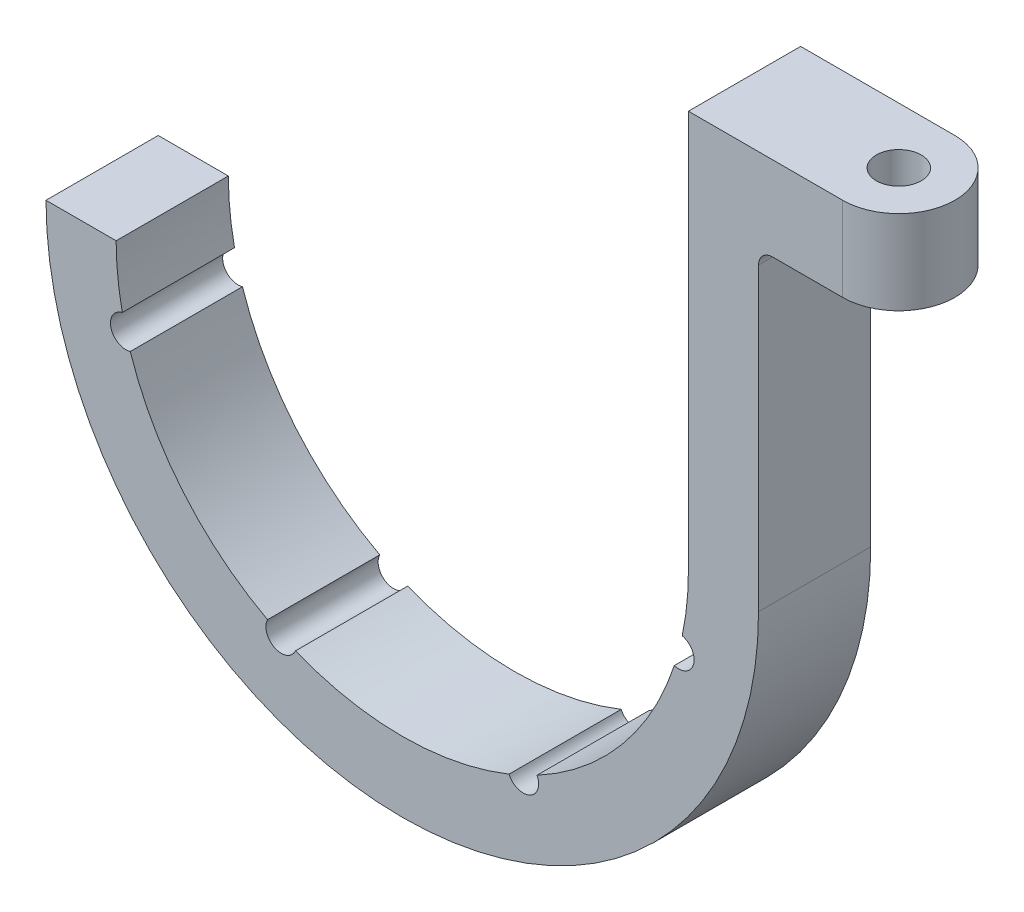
from build123d import *

# Parameters (mm, degrees)
BOSS_EXTRUDE1_DEPTH = 8
SKETCH2_R           = 1.6
BOSS_EXTRUDE2_DEPTH = 6
FILLET1_R           = 1


with BuildPart() as part:
    # Sketch1 → Boss-Extrude1 (new body)
    with BuildSketch(Plane.XY):
        with BuildLine():
            ThreePointArc((-19.960837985, -4.210100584), (-20.289912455, -2.116471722), (-20.4, 0))
            Line((-20.4, 0), (-25.4, 0))
            ThreePointArc((-25.4, 0), (0, -25.4), (25.4, 0))
            ThreePointArc((25.4, 0), (24.117628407, 7.968688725), (20.4, 15.13274595))
            Line((20.4, 15.13274595), (20.4, 0))
            ThreePointArc((20.4, 0), (20.289912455, -2.116471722), (19.960837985, -4.210100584))
            ThreePointArc((19.960837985, -4.210100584), (20.568468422, -4.598566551), (20.804886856, -5.27990852))
            ThreePointArc((20.804886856, -5.27990852), (20.362698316, -6.161545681), (19.391643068, -6.334364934))
            ThreePointArc((19.391643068, -6.334364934), (15.62730664, -13.112867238), (9.605455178, -17.99708951))
            ThreePointArc((9.605455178, -17.99708951), (9.692030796, -18.236138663), (9.72141254, -18.488678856))
            ThreePointArc((9.72141254, -18.488678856), (8.844996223, -19.565716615), (7.612302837, -18.92651171))
            ThreePointArc((7.612302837, -18.92651171), (0, -20.4), (-7.612302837, -18.92651171))
            ThreePointArc((-7.612302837, -18.92651171), (-9.086292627, -19.485617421), (-9.605455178, -17.99708951))
            ThreePointArc((-9.605455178, -17.99708951), (-15.62730664, -13.112867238), (-19.391643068, -6.334364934))
            ThreePointArc((-19.391643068, -6.334364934), (-20.767405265, -5.56460947), (-19.960837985, -4.210100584))
        make_face()
        with BuildLine():
            ThreePointArc((20.4, 15.13274595), (24.117628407, 7.968688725), (25.4, 0))
            Line((25.4, 0), (25.4, 28.4))
            Line((25.4, 28.4), (20.4, 28.4))
            Line((20.4, 28.4), (20.4, 15.13274595))
        make_face()
    extrude(amount=BOSS_EXTRUDE1_DEPTH)

    # Sketch2 → Boss-Extrude2 (add)
    with BuildSketch(Plane(origin=(0, 28.4, 0), x_dir=(1, 0, 0), z_dir=(0, 1, 0))):
        with BuildLine():
            Line((25.4, -8), (25.4, 0))
            Line((25.4, 0), (31.4, 0))
            ThreePointArc((31.4, 0), (35.4, -4), (31.4, -8))
            Line((31.4, -8), (25.4, -8))
        make_face()
        with Locations(Location((31.4, -4, 0), (0, 0, 270))):
            Circle(SKETCH2_R, mode=Mode.SUBTRACT)
    extrude(amount=-BOSS_EXTRUDE2_DEPTH)

    # Fillet1
    fillet1_edges = [part.edges().sort_by_distance(p)[0] for p in [
        (25.4, 22.4, 4),
    ]]
    fillet(fillet1_edges, radius=FILLET1_R)


solid = part.part
